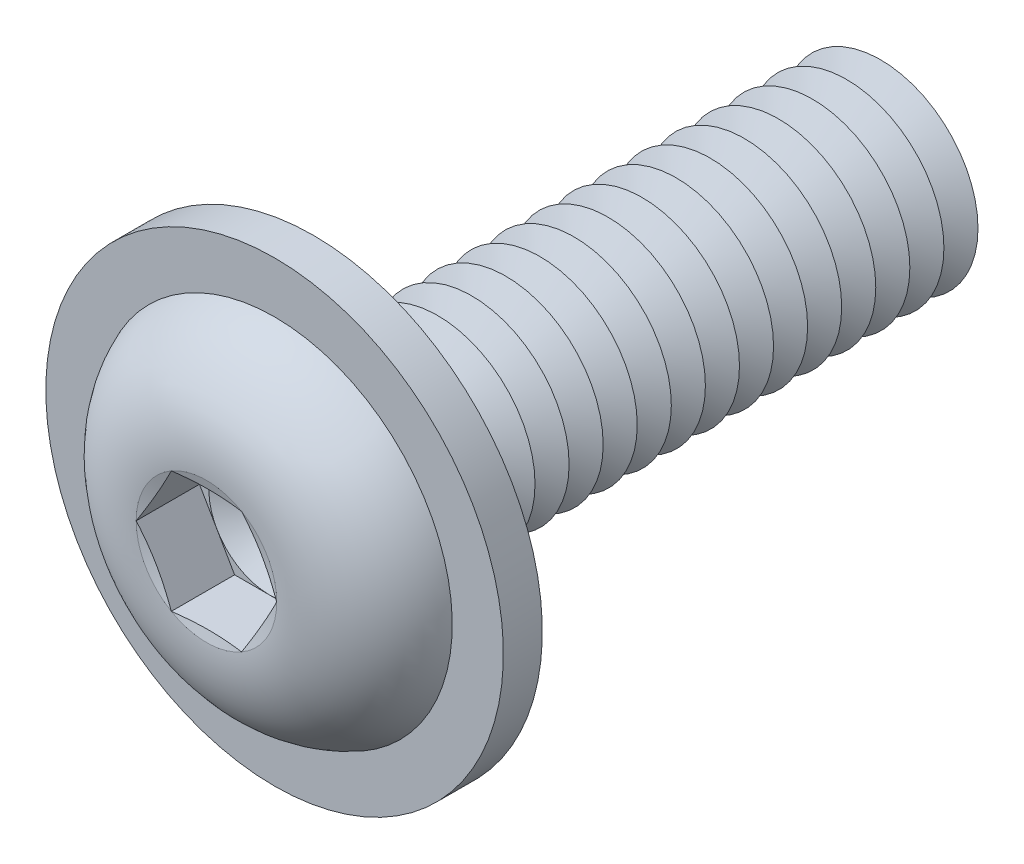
ISO-10303-21;
HEADER;
FILE_DESCRIPTION(('STEP AP214'),'2;1');
FILE_NAME('part.step','',(''),(''),'','','');
FILE_SCHEMA(('AUTOMOTIVE_DESIGN { 1 0 10303 214 1 1 1 1 }'));
ENDSEC;
DATA;
#1=APPLICATION_CONTEXT('core data for automotive mechanical design processes');
#2=APPLICATION_PROTOCOL_DEFINITION('international standard','automotive_design',2000,#1);
#3=PRODUCT_CONTEXT('',#1,'mechanical');
#4=PRODUCT('Part','Part','',(#3));
#5=PRODUCT_RELATED_PRODUCT_CATEGORY('part','',(#4));
#6=PRODUCT_DEFINITION_FORMATION('','',#4);
#7=PRODUCT_DEFINITION_CONTEXT('part definition',#1,'design');
#8=PRODUCT_DEFINITION('design','',#6,#7);
#9=PRODUCT_DEFINITION_SHAPE('','',#8);
#10=(LENGTH_UNIT() NAMED_UNIT(*) SI_UNIT(.MILLI.,.METRE.));
#11=(NAMED_UNIT(*) PLANE_ANGLE_UNIT() SI_UNIT($,.RADIAN.));
#12=(NAMED_UNIT(*) SI_UNIT($,.STERADIAN.) SOLID_ANGLE_UNIT());
#13=UNCERTAINTY_MEASURE_WITH_UNIT(LENGTH_MEASURE(1.E-05),#10,'distance_accuracy_value','');
#14=(GEOMETRIC_REPRESENTATION_CONTEXT(3) GLOBAL_UNCERTAINTY_ASSIGNED_CONTEXT((#13)) GLOBAL_UNIT_ASSIGNED_CONTEXT((#10,
#11,#12)) REPRESENTATION_CONTEXT('',''));
#15=CARTESIAN_POINT('',(0.,0.,0.));
#16=DIRECTION('',(0.,0.,1.));
#17=DIRECTION('',(1.,0.,0.));
#18=AXIS2_PLACEMENT_3D('',#15,#16,#17);
#19=CARTESIAN_POINT('',(0.,0.,-9.55));
#20=DIRECTION('',(0.,0.,1.));
#21=DIRECTION('',(1.,0.,0.));
#22=AXIS2_PLACEMENT_3D('',#19,#20,#21);
#23=CONICAL_SURFACE('',#22,2.,1.0471975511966);
#24=CARTESIAN_POINT('',(0.,0.,-9.9));
#25=DIRECTION('',(0.,0.,1.));
#26=DIRECTION('',(1.,0.,0.));
#27=AXIS2_PLACEMENT_3D('',#24,#25,#26);
#28=CIRCLE('',#27,1.3937822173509);
#29=CARTESIAN_POINT('',(1.3937822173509,0.,-9.9));
#30=VERTEX_POINT('',#29);
#31=EDGE_CURVE('E346',#30,#30,#28,.T.);
#32=ORIENTED_EDGE('',*,*,#31,.T.);
#33=EDGE_LOOP('',(#32));
#34=FACE_BOUND('',#33,.T.);
#35=CARTESIAN_POINT('',(0.,0.,-9.55));
#36=DIRECTION('',(0.,0.,1.));
#37=DIRECTION('',(1.,0.,0.));
#38=AXIS2_PLACEMENT_3D('',#35,#36,#37);
#39=CIRCLE('',#38,2.);
#40=CARTESIAN_POINT('',(2.,0.,-9.55));
#41=VERTEX_POINT('',#40);
#42=EDGE_CURVE('E342',#41,#41,#39,.T.);
#43=ORIENTED_EDGE('',*,*,#42,.F.);
#44=EDGE_LOOP('',(#43));
#45=FACE_BOUND('',#44,.T.);
#46=ADVANCED_FACE('F39',(#34,#45),#23,.T.);
#47=CARTESIAN_POINT('',(0.,0.,-9.9));
#48=DIRECTION('',(0.,0.,-1.));
#49=DIRECTION('',(-1.,0.,0.));
#50=AXIS2_PLACEMENT_3D('',#47,#48,#49);
#51=CONICAL_SURFACE('',#50,1.3937822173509,1.0471975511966);
#52=CARTESIAN_POINT('',(0.,0.,-10.25));
#53=DIRECTION('',(0.,0.,1.));
#54=DIRECTION('',(1.,0.,0.));
#55=AXIS2_PLACEMENT_3D('',#52,#53,#54);
#56=CIRCLE('',#55,2.);
#57=CARTESIAN_POINT('',(2.,0.,-10.25));
#58=VERTEX_POINT('',#57);
#59=EDGE_CURVE('E350',#58,#58,#56,.T.);
#60=ORIENTED_EDGE('',*,*,#59,.T.);
#61=EDGE_LOOP('',(#60));
#62=FACE_BOUND('',#61,.T.);
#63=ORIENTED_EDGE('',*,*,#31,.F.);
#64=EDGE_LOOP('',(#63));
#65=FACE_BOUND('',#64,.T.);
#66=ADVANCED_FACE('F474',(#62,#65),#51,.T.);
#67=CARTESIAN_POINT('',(0.,2.00000000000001,-12.));
#68=DIRECTION('',(0.,0.,-1.));
#69=DIRECTION('',(-1.,0.,0.));
#70=AXIS2_PLACEMENT_3D('',#67,#68,#69);
#71=PLANE('',#70);
#72=CARTESIAN_POINT('',(0.,0.,-12.));
#73=DIRECTION('',(0.,0.,1.));
#74=DIRECTION('',(1.,0.,0.));
#75=AXIS2_PLACEMENT_3D('',#72,#73,#74);
#76=CIRCLE('',#75,1.3937822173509);
#77=CARTESIAN_POINT('',(1.3937822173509,0.,-12.));
#78=VERTEX_POINT('',#77);
#79=EDGE_CURVE('E370',#78,#78,#76,.T.);
#80=ORIENTED_EDGE('',*,*,#79,.F.);
#81=EDGE_LOOP('',(#80));
#82=FACE_BOUND('',#81,.T.);
#83=ADVANCED_FACE('F480',(#82),#71,.T.);
#84=CARTESIAN_POINT('',(0.,0.,-11.65));
#85=DIRECTION('',(0.,0.,1.));
#86=DIRECTION('',(1.,0.,0.));
#87=AXIS2_PLACEMENT_3D('',#84,#85,#86);
#88=CONICAL_SURFACE('',#87,2.,1.0471975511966);
#89=ORIENTED_EDGE('',*,*,#79,.T.);
#90=EDGE_LOOP('',(#89));
#91=FACE_BOUND('',#90,.T.);
#92=CARTESIAN_POINT('',(0.,0.,-11.65));
#93=DIRECTION('',(0.,0.,1.));
#94=DIRECTION('',(1.,0.,0.));
#95=AXIS2_PLACEMENT_3D('',#92,#93,#94);
#96=CIRCLE('',#95,2.);
#97=CARTESIAN_POINT('',(2.,0.,-11.65));
#98=VERTEX_POINT('',#97);
#99=EDGE_CURVE('E366',#98,#98,#96,.T.);
#100=ORIENTED_EDGE('',*,*,#99,.F.);
#101=EDGE_LOOP('',(#100));
#102=FACE_BOUND('',#101,.T.);
#103=ADVANCED_FACE('F499',(#91,#102),#88,.T.);
#104=CARTESIAN_POINT('',(0.,0.,-11.3));
#105=DIRECTION('',(0.,0.,-1.));
#106=DIRECTION('',(-1.,0.,0.));
#107=AXIS2_PLACEMENT_3D('',#104,#105,#106);
#108=CONICAL_SURFACE('',#107,1.3937822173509,1.0471975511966);
#109=ORIENTED_EDGE('',*,*,#99,.T.);
#110=EDGE_LOOP('',(#109));
#111=FACE_BOUND('',#110,.T.);
#112=CARTESIAN_POINT('',(0.,0.,-11.3));
#113=DIRECTION('',(0.,0.,1.));
#114=DIRECTION('',(1.,0.,0.));
#115=AXIS2_PLACEMENT_3D('',#112,#113,#114);
#116=CIRCLE('',#115,1.3937822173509);
#117=CARTESIAN_POINT('',(1.3937822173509,0.,-11.3));
#118=VERTEX_POINT('',#117);
#119=EDGE_CURVE('E362',#118,#118,#116,.T.);
#120=ORIENTED_EDGE('',*,*,#119,.F.);
#121=EDGE_LOOP('',(#120));
#122=FACE_BOUND('',#121,.T.);
#123=ADVANCED_FACE('F496',(#111,#122),#108,.T.);
#124=CARTESIAN_POINT('',(0.,0.,-10.95));
#125=DIRECTION('',(0.,0.,1.));
#126=DIRECTION('',(1.,0.,0.));
#127=AXIS2_PLACEMENT_3D('',#124,#125,#126);
#128=CONICAL_SURFACE('',#127,2.,1.0471975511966);
#129=ORIENTED_EDGE('',*,*,#119,.T.);
#130=EDGE_LOOP('',(#129));
#131=FACE_BOUND('',#130,.T.);
#132=CARTESIAN_POINT('',(0.,0.,-10.95));
#133=DIRECTION('',(0.,0.,1.));
#134=DIRECTION('',(1.,0.,0.));
#135=AXIS2_PLACEMENT_3D('',#132,#133,#134);
#136=CIRCLE('',#135,2.);
#137=CARTESIAN_POINT('',(2.,0.,-10.95));
#138=VERTEX_POINT('',#137);
#139=EDGE_CURVE('E358',#138,#138,#136,.T.);
#140=ORIENTED_EDGE('',*,*,#139,.F.);
#141=EDGE_LOOP('',(#140));
#142=FACE_BOUND('',#141,.T.);
#143=ADVANCED_FACE('F490',(#131,#142),#128,.T.);
#144=CARTESIAN_POINT('',(0.,0.,-10.6));
#145=DIRECTION('',(0.,0.,-1.));
#146=DIRECTION('',(-1.,0.,0.));
#147=AXIS2_PLACEMENT_3D('',#144,#145,#146);
#148=CONICAL_SURFACE('',#147,1.3937822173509,1.0471975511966);
#149=ORIENTED_EDGE('',*,*,#139,.T.);
#150=EDGE_LOOP('',(#149));
#151=FACE_BOUND('',#150,.T.);
#152=CARTESIAN_POINT('',(0.,0.,-10.6));
#153=DIRECTION('',(0.,0.,1.));
#154=DIRECTION('',(1.,0.,0.));
#155=AXIS2_PLACEMENT_3D('',#152,#153,#154);
#156=CIRCLE('',#155,1.3937822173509);
#157=CARTESIAN_POINT('',(1.3937822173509,0.,-10.6));
#158=VERTEX_POINT('',#157);
#159=EDGE_CURVE('E354',#158,#158,#156,.T.);
#160=ORIENTED_EDGE('',*,*,#159,.F.);
#161=EDGE_LOOP('',(#160));
#162=FACE_BOUND('',#161,.T.);
#163=ADVANCED_FACE('F486',(#151,#162),#148,.T.);
#164=CARTESIAN_POINT('',(0.,0.,-10.25));
#165=DIRECTION('',(0.,0.,1.));
#166=DIRECTION('',(1.,0.,0.));
#167=AXIS2_PLACEMENT_3D('',#164,#165,#166);
#168=CONICAL_SURFACE('',#167,2.,1.0471975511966);
#169=ORIENTED_EDGE('',*,*,#159,.T.);
#170=EDGE_LOOP('',(#169));
#171=FACE_BOUND('',#170,.T.);
#172=ORIENTED_EDGE('',*,*,#59,.F.);
#173=EDGE_LOOP('',(#172));
#174=FACE_BOUND('',#173,.T.);
#175=ADVANCED_FACE('F489',(#171,#174),#168,.T.);
#176=CARTESIAN_POINT('',(0.,0.,-8.85));
#177=DIRECTION('',(0.,0.,1.));
#178=DIRECTION('',(1.,0.,0.));
#179=AXIS2_PLACEMENT_3D('',#176,#177,#178);
#180=CONICAL_SURFACE('',#179,2.,1.0471975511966);
#181=CARTESIAN_POINT('',(0.,0.,-9.2));
#182=DIRECTION('',(0.,0.,1.));
#183=DIRECTION('',(1.,0.,0.));
#184=AXIS2_PLACEMENT_3D('',#181,#182,#183);
#185=CIRCLE('',#184,1.3937822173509);
#186=CARTESIAN_POINT('',(1.3937822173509,0.,-9.2));
#187=VERTEX_POINT('',#186);
#188=EDGE_CURVE('E338',#187,#187,#185,.T.);
#189=ORIENTED_EDGE('',*,*,#188,.T.);
#190=EDGE_LOOP('',(#189));
#191=FACE_BOUND('',#190,.T.);
#192=CARTESIAN_POINT('',(0.,0.,-8.85));
#193=DIRECTION('',(0.,0.,1.));
#194=DIRECTION('',(1.,0.,0.));
#195=AXIS2_PLACEMENT_3D('',#192,#193,#194);
#196=CIRCLE('',#195,2.);
#197=CARTESIAN_POINT('',(2.,0.,-8.85));
#198=VERTEX_POINT('',#197);
#199=EDGE_CURVE('E334',#198,#198,#196,.T.);
#200=ORIENTED_EDGE('',*,*,#199,.F.);
#201=EDGE_LOOP('',(#200));
#202=FACE_BOUND('',#201,.T.);
#203=ADVANCED_FACE('F494',(#191,#202),#180,.T.);
#204=CARTESIAN_POINT('',(0.,0.,-9.2));
#205=DIRECTION('',(0.,0.,-1.));
#206=DIRECTION('',(-1.,0.,0.));
#207=AXIS2_PLACEMENT_3D('',#204,#205,#206);
#208=CONICAL_SURFACE('',#207,1.3937822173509,1.0471975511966);
#209=ORIENTED_EDGE('',*,*,#42,.T.);
#210=EDGE_LOOP('',(#209));
#211=FACE_BOUND('',#210,.T.);
#212=ORIENTED_EDGE('',*,*,#188,.F.);
#213=EDGE_LOOP('',(#212));
#214=FACE_BOUND('',#213,.T.);
#215=ADVANCED_FACE('F545',(#211,#214),#208,.T.);
#216=CARTESIAN_POINT('',(0.,0.,-8.15));
#217=DIRECTION('',(0.,0.,1.));
#218=DIRECTION('',(1.,0.,0.));
#219=AXIS2_PLACEMENT_3D('',#216,#217,#218);
#220=CONICAL_SURFACE('',#219,2.,1.0471975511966);
#221=CARTESIAN_POINT('',(0.,0.,-8.5));
#222=DIRECTION('',(0.,0.,1.));
#223=DIRECTION('',(1.,0.,0.));
#224=AXIS2_PLACEMENT_3D('',#221,#222,#223);
#225=CIRCLE('',#224,1.3937822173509);
#226=CARTESIAN_POINT('',(1.3937822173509,0.,-8.5));
#227=VERTEX_POINT('',#226);
#228=EDGE_CURVE('E330',#227,#227,#225,.T.);
#229=ORIENTED_EDGE('',*,*,#228,.T.);
#230=EDGE_LOOP('',(#229));
#231=FACE_BOUND('',#230,.T.);
#232=CARTESIAN_POINT('',(0.,0.,-8.15));
#233=DIRECTION('',(0.,0.,1.));
#234=DIRECTION('',(1.,0.,0.));
#235=AXIS2_PLACEMENT_3D('',#232,#233,#234);
#236=CIRCLE('',#235,2.);
#237=CARTESIAN_POINT('',(2.,0.,-8.15));
#238=VERTEX_POINT('',#237);
#239=EDGE_CURVE('E326',#238,#238,#236,.T.);
#240=ORIENTED_EDGE('',*,*,#239,.F.);
#241=EDGE_LOOP('',(#240));
#242=FACE_BOUND('',#241,.T.);
#243=ADVANCED_FACE('F551',(#231,#242),#220,.T.);
#244=CARTESIAN_POINT('',(0.,0.,-8.5));
#245=DIRECTION('',(0.,0.,-1.));
#246=DIRECTION('',(-1.,0.,0.));
#247=AXIS2_PLACEMENT_3D('',#244,#245,#246);
#248=CONICAL_SURFACE('',#247,1.3937822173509,1.0471975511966);
#249=ORIENTED_EDGE('',*,*,#199,.T.);
#250=EDGE_LOOP('',(#249));
#251=FACE_BOUND('',#250,.T.);
#252=ORIENTED_EDGE('',*,*,#228,.F.);
#253=EDGE_LOOP('',(#252));
#254=FACE_BOUND('',#253,.T.);
#255=ADVANCED_FACE('F558',(#251,#254),#248,.T.);
#256=CARTESIAN_POINT('',(0.,0.,-7.45));
#257=DIRECTION('',(0.,0.,1.));
#258=DIRECTION('',(1.,0.,0.));
#259=AXIS2_PLACEMENT_3D('',#256,#257,#258);
#260=CONICAL_SURFACE('',#259,2.,1.0471975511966);
#261=CARTESIAN_POINT('',(0.,0.,-7.8));
#262=DIRECTION('',(0.,0.,1.));
#263=DIRECTION('',(1.,0.,0.));
#264=AXIS2_PLACEMENT_3D('',#261,#262,#263);
#265=CIRCLE('',#264,1.3937822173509);
#266=CARTESIAN_POINT('',(1.3937822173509,0.,-7.8));
#267=VERTEX_POINT('',#266);
#268=EDGE_CURVE('E322',#267,#267,#265,.T.);
#269=ORIENTED_EDGE('',*,*,#268,.T.);
#270=EDGE_LOOP('',(#269));
#271=FACE_BOUND('',#270,.T.);
#272=CARTESIAN_POINT('',(0.,0.,-7.45));
#273=DIRECTION('',(0.,0.,1.));
#274=DIRECTION('',(1.,0.,0.));
#275=AXIS2_PLACEMENT_3D('',#272,#273,#274);
#276=CIRCLE('',#275,2.);
#277=CARTESIAN_POINT('',(2.,0.,-7.45));
#278=VERTEX_POINT('',#277);
#279=EDGE_CURVE('E318',#278,#278,#276,.T.);
#280=ORIENTED_EDGE('',*,*,#279,.F.);
#281=EDGE_LOOP('',(#280));
#282=FACE_BOUND('',#281,.T.);
#283=ADVANCED_FACE('F565',(#271,#282),#260,.T.);
#284=CARTESIAN_POINT('',(0.,0.,-7.8));
#285=DIRECTION('',(0.,0.,-1.));
#286=DIRECTION('',(-1.,0.,0.));
#287=AXIS2_PLACEMENT_3D('',#284,#285,#286);
#288=CONICAL_SURFACE('',#287,1.3937822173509,1.0471975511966);
#289=ORIENTED_EDGE('',*,*,#239,.T.);
#290=EDGE_LOOP('',(#289));
#291=FACE_BOUND('',#290,.T.);
#292=ORIENTED_EDGE('',*,*,#268,.F.);
#293=EDGE_LOOP('',(#292));
#294=FACE_BOUND('',#293,.T.);
#295=ADVANCED_FACE('F572',(#291,#294),#288,.T.);
#296=CARTESIAN_POINT('',(0.,0.,-6.75));
#297=DIRECTION('',(0.,0.,1.));
#298=DIRECTION('',(1.,0.,0.));
#299=AXIS2_PLACEMENT_3D('',#296,#297,#298);
#300=CONICAL_SURFACE('',#299,2.,1.0471975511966);
#301=CARTESIAN_POINT('',(0.,0.,-7.1));
#302=DIRECTION('',(0.,0.,1.));
#303=DIRECTION('',(1.,0.,0.));
#304=AXIS2_PLACEMENT_3D('',#301,#302,#303);
#305=CIRCLE('',#304,1.3937822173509);
#306=CARTESIAN_POINT('',(1.3937822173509,0.,-7.1));
#307=VERTEX_POINT('',#306);
#308=EDGE_CURVE('E314',#307,#307,#305,.T.);
#309=ORIENTED_EDGE('',*,*,#308,.T.);
#310=EDGE_LOOP('',(#309));
#311=FACE_BOUND('',#310,.T.);
#312=CARTESIAN_POINT('',(0.,0.,-6.75));
#313=DIRECTION('',(0.,0.,1.));
#314=DIRECTION('',(1.,0.,0.));
#315=AXIS2_PLACEMENT_3D('',#312,#313,#314);
#316=CIRCLE('',#315,2.);
#317=CARTESIAN_POINT('',(2.,0.,-6.75));
#318=VERTEX_POINT('',#317);
#319=EDGE_CURVE('E310',#318,#318,#316,.T.);
#320=ORIENTED_EDGE('',*,*,#319,.F.);
#321=EDGE_LOOP('',(#320));
#322=FACE_BOUND('',#321,.T.);
#323=ADVANCED_FACE('F579',(#311,#322),#300,.T.);
#324=CARTESIAN_POINT('',(0.,0.,-7.1));
#325=DIRECTION('',(0.,0.,-1.));
#326=DIRECTION('',(-1.,0.,0.));
#327=AXIS2_PLACEMENT_3D('',#324,#325,#326);
#328=CONICAL_SURFACE('',#327,1.3937822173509,1.0471975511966);
#329=ORIENTED_EDGE('',*,*,#279,.T.);
#330=EDGE_LOOP('',(#329));
#331=FACE_BOUND('',#330,.T.);
#332=ORIENTED_EDGE('',*,*,#308,.F.);
#333=EDGE_LOOP('',(#332));
#334=FACE_BOUND('',#333,.T.);
#335=ADVANCED_FACE('F586',(#331,#334),#328,.T.);
#336=CARTESIAN_POINT('',(0.,0.,-6.05));
#337=DIRECTION('',(0.,0.,1.));
#338=DIRECTION('',(1.,0.,0.));
#339=AXIS2_PLACEMENT_3D('',#336,#337,#338);
#340=CONICAL_SURFACE('',#339,2.,1.0471975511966);
#341=CARTESIAN_POINT('',(0.,0.,-6.4));
#342=DIRECTION('',(0.,0.,1.));
#343=DIRECTION('',(1.,0.,0.));
#344=AXIS2_PLACEMENT_3D('',#341,#342,#343);
#345=CIRCLE('',#344,1.3937822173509);
#346=CARTESIAN_POINT('',(1.3937822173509,0.,-6.4));
#347=VERTEX_POINT('',#346);
#348=EDGE_CURVE('E306',#347,#347,#345,.T.);
#349=ORIENTED_EDGE('',*,*,#348,.T.);
#350=EDGE_LOOP('',(#349));
#351=FACE_BOUND('',#350,.T.);
#352=CARTESIAN_POINT('',(0.,0.,-6.05));
#353=DIRECTION('',(0.,0.,1.));
#354=DIRECTION('',(1.,0.,0.));
#355=AXIS2_PLACEMENT_3D('',#352,#353,#354);
#356=CIRCLE('',#355,2.);
#357=CARTESIAN_POINT('',(2.,0.,-6.05));
#358=VERTEX_POINT('',#357);
#359=EDGE_CURVE('E302',#358,#358,#356,.T.);
#360=ORIENTED_EDGE('',*,*,#359,.F.);
#361=EDGE_LOOP('',(#360));
#362=FACE_BOUND('',#361,.T.);
#363=ADVANCED_FACE('F593',(#351,#362),#340,.T.);
#364=CARTESIAN_POINT('',(0.,0.,-6.4));
#365=DIRECTION('',(0.,0.,-1.));
#366=DIRECTION('',(-1.,0.,0.));
#367=AXIS2_PLACEMENT_3D('',#364,#365,#366);
#368=CONICAL_SURFACE('',#367,1.3937822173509,1.0471975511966);
#369=ORIENTED_EDGE('',*,*,#319,.T.);
#370=EDGE_LOOP('',(#369));
#371=FACE_BOUND('',#370,.T.);
#372=ORIENTED_EDGE('',*,*,#348,.F.);
#373=EDGE_LOOP('',(#372));
#374=FACE_BOUND('',#373,.T.);
#375=ADVANCED_FACE('F600',(#371,#374),#368,.T.);
#376=CARTESIAN_POINT('',(0.,0.,-5.35));
#377=DIRECTION('',(0.,0.,1.));
#378=DIRECTION('',(1.,0.,0.));
#379=AXIS2_PLACEMENT_3D('',#376,#377,#378);
#380=CONICAL_SURFACE('',#379,2.,1.0471975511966);
#381=CARTESIAN_POINT('',(0.,0.,-5.7));
#382=DIRECTION('',(0.,0.,1.));
#383=DIRECTION('',(1.,0.,0.));
#384=AXIS2_PLACEMENT_3D('',#381,#382,#383);
#385=CIRCLE('',#384,1.3937822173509);
#386=CARTESIAN_POINT('',(1.3937822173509,0.,-5.7));
#387=VERTEX_POINT('',#386);
#388=EDGE_CURVE('E298',#387,#387,#385,.T.);
#389=ORIENTED_EDGE('',*,*,#388,.T.);
#390=EDGE_LOOP('',(#389));
#391=FACE_BOUND('',#390,.T.);
#392=CARTESIAN_POINT('',(0.,0.,-5.35));
#393=DIRECTION('',(0.,0.,1.));
#394=DIRECTION('',(1.,0.,0.));
#395=AXIS2_PLACEMENT_3D('',#392,#393,#394);
#396=CIRCLE('',#395,2.);
#397=CARTESIAN_POINT('',(2.,0.,-5.35));
#398=VERTEX_POINT('',#397);
#399=EDGE_CURVE('E294',#398,#398,#396,.T.);
#400=ORIENTED_EDGE('',*,*,#399,.F.);
#401=EDGE_LOOP('',(#400));
#402=FACE_BOUND('',#401,.T.);
#403=ADVANCED_FACE('F607',(#391,#402),#380,.T.);
#404=CARTESIAN_POINT('',(0.,0.,-5.7));
#405=DIRECTION('',(0.,0.,-1.));
#406=DIRECTION('',(-1.,0.,0.));
#407=AXIS2_PLACEMENT_3D('',#404,#405,#406);
#408=CONICAL_SURFACE('',#407,1.3937822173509,1.0471975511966);
#409=ORIENTED_EDGE('',*,*,#359,.T.);
#410=EDGE_LOOP('',(#409));
#411=FACE_BOUND('',#410,.T.);
#412=ORIENTED_EDGE('',*,*,#388,.F.);
#413=EDGE_LOOP('',(#412));
#414=FACE_BOUND('',#413,.T.);
#415=ADVANCED_FACE('F614',(#411,#414),#408,.T.);
#416=CARTESIAN_POINT('',(0.,0.,-4.65));
#417=DIRECTION('',(0.,0.,1.));
#418=DIRECTION('',(1.,0.,0.));
#419=AXIS2_PLACEMENT_3D('',#416,#417,#418);
#420=CONICAL_SURFACE('',#419,2.,1.0471975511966);
#421=CARTESIAN_POINT('',(0.,0.,-5.));
#422=DIRECTION('',(0.,0.,1.));
#423=DIRECTION('',(1.,0.,0.));
#424=AXIS2_PLACEMENT_3D('',#421,#422,#423);
#425=CIRCLE('',#424,1.3937822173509);
#426=CARTESIAN_POINT('',(1.3937822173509,0.,-5.));
#427=VERTEX_POINT('',#426);
#428=EDGE_CURVE('E290',#427,#427,#425,.T.);
#429=ORIENTED_EDGE('',*,*,#428,.T.);
#430=EDGE_LOOP('',(#429));
#431=FACE_BOUND('',#430,.T.);
#432=CARTESIAN_POINT('',(0.,0.,-4.65));
#433=DIRECTION('',(0.,0.,1.));
#434=DIRECTION('',(1.,0.,0.));
#435=AXIS2_PLACEMENT_3D('',#432,#433,#434);
#436=CIRCLE('',#435,2.);
#437=CARTESIAN_POINT('',(2.,0.,-4.65));
#438=VERTEX_POINT('',#437);
#439=EDGE_CURVE('E286',#438,#438,#436,.T.);
#440=ORIENTED_EDGE('',*,*,#439,.F.);
#441=EDGE_LOOP('',(#440));
#442=FACE_BOUND('',#441,.T.);
#443=ADVANCED_FACE('F621',(#431,#442),#420,.T.);
#444=CARTESIAN_POINT('',(0.,0.,-5.));
#445=DIRECTION('',(0.,0.,-1.));
#446=DIRECTION('',(-1.,0.,0.));
#447=AXIS2_PLACEMENT_3D('',#444,#445,#446);
#448=CONICAL_SURFACE('',#447,1.3937822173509,1.0471975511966);
#449=ORIENTED_EDGE('',*,*,#399,.T.);
#450=EDGE_LOOP('',(#449));
#451=FACE_BOUND('',#450,.T.);
#452=ORIENTED_EDGE('',*,*,#428,.F.);
#453=EDGE_LOOP('',(#452));
#454=FACE_BOUND('',#453,.T.);
#455=ADVANCED_FACE('F628',(#451,#454),#448,.T.);
#456=CARTESIAN_POINT('',(0.,0.,-3.95));
#457=DIRECTION('',(0.,0.,1.));
#458=DIRECTION('',(1.,0.,0.));
#459=AXIS2_PLACEMENT_3D('',#456,#457,#458);
#460=CONICAL_SURFACE('',#459,2.,1.0471975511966);
#461=CARTESIAN_POINT('',(0.,0.,-4.3));
#462=DIRECTION('',(0.,0.,1.));
#463=DIRECTION('',(1.,0.,0.));
#464=AXIS2_PLACEMENT_3D('',#461,#462,#463);
#465=CIRCLE('',#464,1.3937822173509);
#466=CARTESIAN_POINT('',(1.3937822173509,0.,-4.3));
#467=VERTEX_POINT('',#466);
#468=EDGE_CURVE('E282',#467,#467,#465,.T.);
#469=ORIENTED_EDGE('',*,*,#468,.T.);
#470=EDGE_LOOP('',(#469));
#471=FACE_BOUND('',#470,.T.);
#472=CARTESIAN_POINT('',(0.,0.,-3.95));
#473=DIRECTION('',(0.,0.,1.));
#474=DIRECTION('',(1.,0.,0.));
#475=AXIS2_PLACEMENT_3D('',#472,#473,#474);
#476=CIRCLE('',#475,2.);
#477=CARTESIAN_POINT('',(2.,0.,-3.95));
#478=VERTEX_POINT('',#477);
#479=EDGE_CURVE('E278',#478,#478,#476,.T.);
#480=ORIENTED_EDGE('',*,*,#479,.F.);
#481=EDGE_LOOP('',(#480));
#482=FACE_BOUND('',#481,.T.);
#483=ADVANCED_FACE('F635',(#471,#482),#460,.T.);
#484=CARTESIAN_POINT('',(0.,0.,-4.3));
#485=DIRECTION('',(0.,0.,-1.));
#486=DIRECTION('',(-1.,0.,0.));
#487=AXIS2_PLACEMENT_3D('',#484,#485,#486);
#488=CONICAL_SURFACE('',#487,1.3937822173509,1.0471975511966);
#489=ORIENTED_EDGE('',*,*,#439,.T.);
#490=EDGE_LOOP('',(#489));
#491=FACE_BOUND('',#490,.T.);
#492=ORIENTED_EDGE('',*,*,#468,.F.);
#493=EDGE_LOOP('',(#492));
#494=FACE_BOUND('',#493,.T.);
#495=ADVANCED_FACE('F642',(#491,#494),#488,.T.);
#496=CARTESIAN_POINT('',(0.,0.,-3.25));
#497=DIRECTION('',(0.,0.,1.));
#498=DIRECTION('',(1.,0.,0.));
#499=AXIS2_PLACEMENT_3D('',#496,#497,#498);
#500=CONICAL_SURFACE('',#499,2.,1.0471975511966);
#501=CARTESIAN_POINT('',(0.,0.,-3.6));
#502=DIRECTION('',(0.,0.,1.));
#503=DIRECTION('',(1.,0.,0.));
#504=AXIS2_PLACEMENT_3D('',#501,#502,#503);
#505=CIRCLE('',#504,1.3937822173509);
#506=CARTESIAN_POINT('',(1.3937822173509,0.,-3.6));
#507=VERTEX_POINT('',#506);
#508=EDGE_CURVE('E274',#507,#507,#505,.T.);
#509=ORIENTED_EDGE('',*,*,#508,.T.);
#510=EDGE_LOOP('',(#509));
#511=FACE_BOUND('',#510,.T.);
#512=CARTESIAN_POINT('',(0.,0.,-3.25));
#513=DIRECTION('',(0.,0.,1.));
#514=DIRECTION('',(1.,0.,0.));
#515=AXIS2_PLACEMENT_3D('',#512,#513,#514);
#516=CIRCLE('',#515,2.);
#517=CARTESIAN_POINT('',(2.,0.,-3.25));
#518=VERTEX_POINT('',#517);
#519=EDGE_CURVE('E270',#518,#518,#516,.T.);
#520=ORIENTED_EDGE('',*,*,#519,.F.);
#521=EDGE_LOOP('',(#520));
#522=FACE_BOUND('',#521,.T.);
#523=ADVANCED_FACE('F649',(#511,#522),#500,.T.);
#524=CARTESIAN_POINT('',(0.,0.,-3.6));
#525=DIRECTION('',(0.,0.,-1.));
#526=DIRECTION('',(-1.,0.,0.));
#527=AXIS2_PLACEMENT_3D('',#524,#525,#526);
#528=CONICAL_SURFACE('',#527,1.3937822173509,1.0471975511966);
#529=ORIENTED_EDGE('',*,*,#479,.T.);
#530=EDGE_LOOP('',(#529));
#531=FACE_BOUND('',#530,.T.);
#532=ORIENTED_EDGE('',*,*,#508,.F.);
#533=EDGE_LOOP('',(#532));
#534=FACE_BOUND('',#533,.T.);
#535=ADVANCED_FACE('F656',(#531,#534),#528,.T.);
#536=CARTESIAN_POINT('',(0.,0.,-2.55));
#537=DIRECTION('',(0.,0.,1.));
#538=DIRECTION('',(1.,0.,0.));
#539=AXIS2_PLACEMENT_3D('',#536,#537,#538);
#540=CONICAL_SURFACE('',#539,2.,1.0471975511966);
#541=CARTESIAN_POINT('',(0.,0.,-2.9));
#542=DIRECTION('',(0.,0.,1.));
#543=DIRECTION('',(1.,0.,0.));
#544=AXIS2_PLACEMENT_3D('',#541,#542,#543);
#545=CIRCLE('',#544,1.3937822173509);
#546=CARTESIAN_POINT('',(1.3937822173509,0.,-2.9));
#547=VERTEX_POINT('',#546);
#548=EDGE_CURVE('E266',#547,#547,#545,.T.);
#549=ORIENTED_EDGE('',*,*,#548,.T.);
#550=EDGE_LOOP('',(#549));
#551=FACE_BOUND('',#550,.T.);
#552=CARTESIAN_POINT('',(0.,0.,-2.55));
#553=DIRECTION('',(0.,0.,1.));
#554=DIRECTION('',(1.,0.,0.));
#555=AXIS2_PLACEMENT_3D('',#552,#553,#554);
#556=CIRCLE('',#555,2.);
#557=CARTESIAN_POINT('',(2.,0.,-2.55));
#558=VERTEX_POINT('',#557);
#559=EDGE_CURVE('E262',#558,#558,#556,.T.);
#560=ORIENTED_EDGE('',*,*,#559,.F.);
#561=EDGE_LOOP('',(#560));
#562=FACE_BOUND('',#561,.T.);
#563=ADVANCED_FACE('F663',(#551,#562),#540,.T.);
#564=CARTESIAN_POINT('',(0.,0.,-2.9));
#565=DIRECTION('',(0.,0.,-1.));
#566=DIRECTION('',(-1.,0.,0.));
#567=AXIS2_PLACEMENT_3D('',#564,#565,#566);
#568=CONICAL_SURFACE('',#567,1.3937822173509,1.0471975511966);
#569=ORIENTED_EDGE('',*,*,#519,.T.);
#570=EDGE_LOOP('',(#569));
#571=FACE_BOUND('',#570,.T.);
#572=ORIENTED_EDGE('',*,*,#548,.F.);
#573=EDGE_LOOP('',(#572));
#574=FACE_BOUND('',#573,.T.);
#575=ADVANCED_FACE('F670',(#571,#574),#568,.T.);
#576=CARTESIAN_POINT('',(0.,0.,-1.85));
#577=DIRECTION('',(0.,0.,1.));
#578=DIRECTION('',(1.,0.,0.));
#579=AXIS2_PLACEMENT_3D('',#576,#577,#578);
#580=CONICAL_SURFACE('',#579,2.,1.0471975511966);
#581=CARTESIAN_POINT('',(0.,0.,-2.2));
#582=DIRECTION('',(0.,0.,1.));
#583=DIRECTION('',(1.,0.,0.));
#584=AXIS2_PLACEMENT_3D('',#581,#582,#583);
#585=CIRCLE('',#584,1.3937822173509);
#586=CARTESIAN_POINT('',(1.3937822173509,0.,-2.2));
#587=VERTEX_POINT('',#586);
#588=EDGE_CURVE('E258',#587,#587,#585,.T.);
#589=ORIENTED_EDGE('',*,*,#588,.T.);
#590=EDGE_LOOP('',(#589));
#591=FACE_BOUND('',#590,.T.);
#592=CARTESIAN_POINT('',(0.,0.,-1.85));
#593=DIRECTION('',(0.,0.,1.));
#594=DIRECTION('',(1.,0.,0.));
#595=AXIS2_PLACEMENT_3D('',#592,#593,#594);
#596=CIRCLE('',#595,2.);
#597=CARTESIAN_POINT('',(2.,0.,-1.85));
#598=VERTEX_POINT('',#597);
#599=EDGE_CURVE('E254',#598,#598,#596,.T.);
#600=ORIENTED_EDGE('',*,*,#599,.F.);
#601=EDGE_LOOP('',(#600));
#602=FACE_BOUND('',#601,.T.);
#603=ADVANCED_FACE('F677',(#591,#602),#580,.T.);
#604=CARTESIAN_POINT('',(0.,0.,-2.2));
#605=DIRECTION('',(0.,0.,-1.));
#606=DIRECTION('',(-1.,0.,0.));
#607=AXIS2_PLACEMENT_3D('',#604,#605,#606);
#608=CONICAL_SURFACE('',#607,1.3937822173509,1.0471975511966);
#609=ORIENTED_EDGE('',*,*,#559,.T.);
#610=EDGE_LOOP('',(#609));
#611=FACE_BOUND('',#610,.T.);
#612=ORIENTED_EDGE('',*,*,#588,.F.);
#613=EDGE_LOOP('',(#612));
#614=FACE_BOUND('',#613,.T.);
#615=ADVANCED_FACE('F684',(#611,#614),#608,.T.);
#616=CARTESIAN_POINT('',(0.,0.,-1.15));
#617=DIRECTION('',(0.,0.,1.));
#618=DIRECTION('',(1.,0.,0.));
#619=AXIS2_PLACEMENT_3D('',#616,#617,#618);
#620=CONICAL_SURFACE('',#619,2.,1.0471975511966);
#621=CARTESIAN_POINT('',(0.,0.,-1.5));
#622=DIRECTION('',(0.,0.,1.));
#623=DIRECTION('',(1.,0.,0.));
#624=AXIS2_PLACEMENT_3D('',#621,#622,#623);
#625=CIRCLE('',#624,1.3937822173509);
#626=CARTESIAN_POINT('',(1.3937822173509,0.,-1.5));
#627=VERTEX_POINT('',#626);
#628=EDGE_CURVE('E250',#627,#627,#625,.T.);
#629=ORIENTED_EDGE('',*,*,#628,.T.);
#630=EDGE_LOOP('',(#629));
#631=FACE_BOUND('',#630,.T.);
#632=CARTESIAN_POINT('',(0.,0.,-1.15));
#633=DIRECTION('',(0.,0.,1.));
#634=DIRECTION('',(1.,0.,0.));
#635=AXIS2_PLACEMENT_3D('',#632,#633,#634);
#636=CIRCLE('',#635,2.);
#637=CARTESIAN_POINT('',(2.,0.,-1.15));
#638=VERTEX_POINT('',#637);
#639=EDGE_CURVE('E242',#638,#638,#636,.T.);
#640=ORIENTED_EDGE('',*,*,#639,.F.);
#641=EDGE_LOOP('',(#640));
#642=FACE_BOUND('',#641,.T.);
#643=ADVANCED_FACE('F691',(#631,#642),#620,.T.);
#644=CARTESIAN_POINT('',(0.,0.,-1.5));
#645=DIRECTION('',(0.,0.,-1.));
#646=DIRECTION('',(-1.,0.,0.));
#647=AXIS2_PLACEMENT_3D('',#644,#645,#646);
#648=CONICAL_SURFACE('',#647,1.3937822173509,1.0471975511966);
#649=ORIENTED_EDGE('',*,*,#599,.T.);
#650=EDGE_LOOP('',(#649));
#651=FACE_BOUND('',#650,.T.);
#652=ORIENTED_EDGE('',*,*,#628,.F.);
#653=EDGE_LOOP('',(#652));
#654=FACE_BOUND('',#653,.T.);
#655=ADVANCED_FACE('F698',(#651,#654),#648,.T.);
#656=CARTESIAN_POINT('',(0.,0.,-0.450000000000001));
#657=DIRECTION('',(0.,0.,1.));
#658=DIRECTION('',(1.,0.,0.));
#659=AXIS2_PLACEMENT_3D('',#656,#657,#658);
#660=CONICAL_SURFACE('',#659,2.,1.0471975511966);
#661=CARTESIAN_POINT('',(0.,0.,-0.8));
#662=DIRECTION('',(0.,0.,1.));
#663=DIRECTION('',(1.,0.,0.));
#664=AXIS2_PLACEMENT_3D('',#661,#662,#663);
#665=CIRCLE('',#664,1.3937822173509);
#666=CARTESIAN_POINT('',(1.3937822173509,0.,-0.8));
#667=VERTEX_POINT('',#666);
#668=EDGE_CURVE('E231',#667,#667,#665,.T.);
#669=ORIENTED_EDGE('',*,*,#668,.T.);
#670=EDGE_LOOP('',(#669));
#671=FACE_BOUND('',#670,.T.);
#672=CARTESIAN_POINT('',(0.,0.,-0.450000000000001));
#673=DIRECTION('',(0.,0.,1.));
#674=DIRECTION('',(1.,0.,0.));
#675=AXIS2_PLACEMENT_3D('',#672,#673,#674);
#676=CIRCLE('',#675,2.);
#677=CARTESIAN_POINT('',(2.,0.,-0.450000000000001));
#678=VERTEX_POINT('',#677);
#679=EDGE_CURVE('E246',#678,#678,#676,.T.);
#680=ORIENTED_EDGE('',*,*,#679,.F.);
#681=EDGE_LOOP('',(#680));
#682=FACE_BOUND('',#681,.T.);
#683=ADVANCED_FACE('F705',(#671,#682),#660,.T.);
#684=CARTESIAN_POINT('',(0.,0.,-0.8));
#685=DIRECTION('',(0.,0.,-1.));
#686=DIRECTION('',(-1.,0.,0.));
#687=AXIS2_PLACEMENT_3D('',#684,#685,#686);
#688=CONICAL_SURFACE('',#687,1.3937822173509,1.0471975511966);
#689=ORIENTED_EDGE('',*,*,#639,.T.);
#690=EDGE_LOOP('',(#689));
#691=FACE_BOUND('',#690,.T.);
#692=ORIENTED_EDGE('',*,*,#668,.F.);
#693=EDGE_LOOP('',(#692));
#694=FACE_BOUND('',#693,.T.);
#695=ADVANCED_FACE('F220',(#691,#694),#688,.T.);
#696=CARTESIAN_POINT('',(0.,2.,0.));
#697=DIRECTION('',(0.,0.,-1.));
#698=DIRECTION('',(-1.,0.,0.));
#699=AXIS2_PLACEMENT_3D('',#696,#697,#698);
#700=PLANE('',#699);
#701=CARTESIAN_POINT('',(0.,0.,0.));
#702=DIRECTION('',(0.,0.,-1.));
#703=DIRECTION('',(-1.,0.,0.));
#704=AXIS2_PLACEMENT_3D('',#701,#702,#703);
#705=CIRCLE('',#704,2.35);
#706=CARTESIAN_POINT('',(-2.35,0.,0.));
#707=VERTEX_POINT('',#706);
#708=EDGE_CURVE('E384',#707,#707,#705,.F.);
#709=ORIENTED_EDGE('',*,*,#708,.T.);
#710=EDGE_LOOP('',(#709));
#711=FACE_BOUND('',#710,.T.);
#712=CARTESIAN_POINT('',(0.,0.,0.));
#713=DIRECTION('',(0.,0.,-1.));
#714=DIRECTION('',(0.,1.,0.));
#715=AXIS2_PLACEMENT_3D('',#712,#713,#714);
#716=CIRCLE('',#715,4.7);
#717=CARTESIAN_POINT('',(0.,4.7,0.));
#718=VERTEX_POINT('',#717);
#719=EDGE_CURVE('E1077',#718,#718,#716,.T.);
#720=ORIENTED_EDGE('',*,*,#719,.T.);
#721=EDGE_LOOP('',(#720));
#722=FACE_BOUND('',#721,.T.);
#723=ADVANCED_FACE('F717',(#711,#722),#700,.T.);
#724=CARTESIAN_POINT('',(0.,0.,-0.35));
#725=DIRECTION('',(0.,0.,-1.));
#726=DIRECTION('',(-1.,0.,0.));
#727=AXIS2_PLACEMENT_3D('',#724,#725,#726);
#728=TOROIDAL_SURFACE('',#727,2.35,0.35);
#729=ORIENTED_EDGE('',*,*,#708,.F.);
#730=EDGE_LOOP('',(#729));
#731=FACE_BOUND('',#730,.T.);
#732=CARTESIAN_POINT('',(0.,0.,-0.35));
#733=DIRECTION('',(0.,0.,-1.));
#734=DIRECTION('',(-1.,0.,0.));
#735=AXIS2_PLACEMENT_3D('',#732,#733,#734);
#736=CIRCLE('',#735,2.);
#737=CARTESIAN_POINT('',(-2.,0.,-0.35));
#738=VERTEX_POINT('',#737);
#739=EDGE_CURVE('E379',#738,#738,#736,.T.);
#740=ORIENTED_EDGE('',*,*,#739,.F.);
#741=EDGE_LOOP('',(#740));
#742=FACE_BOUND('',#741,.T.);
#743=ADVANCED_FACE('F41',(#731,#742),#728,.F.);
#744=CARTESIAN_POINT('',(0.,0.,-12.));
#745=DIRECTION('',(0.,0.,-1.));
#746=DIRECTION('',(-1.,0.,0.));
#747=AXIS2_PLACEMENT_3D('',#744,#745,#746);
#748=CYLINDRICAL_SURFACE('',#747,2.);
#749=ORIENTED_EDGE('',*,*,#739,.T.);
#750=EDGE_LOOP('',(#749));
#751=FACE_BOUND('',#750,.T.);
#752=ORIENTED_EDGE('',*,*,#679,.T.);
#753=EDGE_LOOP('',(#752));
#754=FACE_BOUND('',#753,.T.);
#755=ADVANCED_FACE('F729',(#751,#754),#748,.T.);
#756=CARTESIAN_POINT('',(0.,0.,0.8));
#757=DIRECTION('',(0.,0.,-1.));
#758=DIRECTION('',(0.,1.,0.));
#759=AXIS2_PLACEMENT_3D('',#756,#757,#758);
#760=CYLINDRICAL_SURFACE('',#759,4.7);
#761=CARTESIAN_POINT('',(0.,0.,0.8));
#762=DIRECTION('',(0.,0.,-1.));
#763=DIRECTION('',(0.,1.,0.));
#764=AXIS2_PLACEMENT_3D('',#761,#762,#763);
#765=CIRCLE('',#764,4.7);
#766=CARTESIAN_POINT('',(0.,4.7,0.8));
#767=VERTEX_POINT('',#766);
#768=EDGE_CURVE('E1080',#767,#767,#765,.T.);
#769=ORIENTED_EDGE('',*,*,#768,.T.);
#770=EDGE_LOOP('',(#769));
#771=FACE_BOUND('',#770,.T.);
#772=ORIENTED_EDGE('',*,*,#719,.F.);
#773=EDGE_LOOP('',(#772));
#774=FACE_BOUND('',#773,.T.);
#775=ADVANCED_FACE('F735',(#771,#774),#760,.T.);
#776=CARTESIAN_POINT('',(0.,0.,0.8));
#777=DIRECTION('',(0.,0.,-1.));
#778=DIRECTION('',(0.,1.,0.));
#779=AXIS2_PLACEMENT_3D('',#776,#777,#778);
#780=PLANE('',#779);
#781=CARTESIAN_POINT('',(0.,0.,0.8));
#782=DIRECTION('',(0.,0.,-1.));
#783=DIRECTION('',(0.,1.,0.));
#784=AXIS2_PLACEMENT_3D('',#781,#782,#783);
#785=CIRCLE('',#784,3.64977164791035);
#786=CARTESIAN_POINT('',(0.,3.64977164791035,0.8));
#787=VERTEX_POINT('',#786);
#788=EDGE_CURVE('E43',#787,#787,#785,.F.);
#789=ORIENTED_EDGE('',*,*,#788,.F.);
#790=EDGE_LOOP('',(#789));
#791=FACE_BOUND('',#790,.T.);
#792=ORIENTED_EDGE('',*,*,#768,.F.);
#793=EDGE_LOOP('',(#792));
#794=FACE_BOUND('',#793,.T.);
#795=ADVANCED_FACE('F117',(#791,#794),#780,.F.);
#796=CARTESIAN_POINT('',(0.,0.,0.9));
#797=DIRECTION('',(0.,0.,1.));
#798=DIRECTION('',(1.,0.,0.));
#799=AXIS2_PLACEMENT_3D('',#796,#797,#798);
#800=CONICAL_SURFACE('',#799,1.24999941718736,1.0471975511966);
#801=CARTESIAN_POINT('',(0.,0.,0.178312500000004));
#802=VERTEX_POINT('',#801);
#803=VERTEX_LOOP('',#802);
#804=FACE_BOUND('',#803,.T.);
#805=CARTESIAN_POINT('',(0.,0.,0.9));
#806=DIRECTION('',(0.,0.,1.));
#807=DIRECTION('',(1.,0.,0.));
#808=AXIS2_PLACEMENT_3D('',#805,#806,#807);
#809=CIRCLE('',#808,1.24999941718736);
#810=CARTESIAN_POINT('',(1.08253125,0.624999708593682,0.9));
#811=VERTEX_POINT('',#810);
#812=CARTESIAN_POINT('',(0.,1.24999941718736,0.9));
#813=VERTEX_POINT('',#812);
#814=EDGE_CURVE('E120',#811,#813,#809,.T.);
#815=ORIENTED_EDGE('',*,*,#814,.T.);
#816=CARTESIAN_POINT('',(0.,0.,0.9));
#817=DIRECTION('',(0.,0.,1.));
#818=DIRECTION('',(1.,0.,0.));
#819=AXIS2_PLACEMENT_3D('',#816,#817,#818);
#820=CIRCLE('',#819,1.24999941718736);
#821=CARTESIAN_POINT('',(-1.08253125,0.624999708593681,0.9));
#822=VERTEX_POINT('',#821);
#823=EDGE_CURVE('E11',#813,#822,#820,.T.);
#824=ORIENTED_EDGE('',*,*,#823,.T.);
#825=CARTESIAN_POINT('',(-1.08253125,-0.624999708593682,0.9));
#826=VERTEX_POINT('',#825);
#827=EDGE_CURVE('E49',#822,#826,#820,.T.);
#828=ORIENTED_EDGE('',*,*,#827,.T.);
#829=CARTESIAN_POINT('',(0.,-1.24999941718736,0.9));
#830=VERTEX_POINT('',#829);
#831=EDGE_CURVE('E389',#826,#830,#820,.T.);
#832=ORIENTED_EDGE('',*,*,#831,.T.);
#833=CARTESIAN_POINT('',(1.08253125,-0.624999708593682,0.9));
#834=VERTEX_POINT('',#833);
#835=EDGE_CURVE('E57',#830,#834,#820,.T.);
#836=ORIENTED_EDGE('',*,*,#835,.T.);
#837=EDGE_CURVE('E50',#834,#811,#820,.T.);
#838=ORIENTED_EDGE('',*,*,#837,.T.);
#839=EDGE_LOOP('',(#815,#824,#828,#832,#836,#838));
#840=FACE_BOUND('',#839,.T.);
#841=ADVANCED_FACE('F114',(#804,#840),#800,.F.);
#842=CARTESIAN_POINT('',(0.,0.,0.9));
#843=DIRECTION('',(0.,0.,1.));
#844=DIRECTION('',(1.,0.,0.));
#845=AXIS2_PLACEMENT_3D('',#842,#843,#844);
#846=PLANE('',#845);
#847=ORIENTED_EDGE('',*,*,#831,.F.);
#848=DIRECTION('',(0.5,-0.866025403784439,0.));
#849=VECTOR('',#848,1.);
#850=CARTESIAN_POINT('',(-1.443375,0.,0.9));
#851=LINE('',#850,#849);
#852=CARTESIAN_POINT('',(-0.7216875,-1.24999941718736,0.9));
#853=VERTEX_POINT('',#852);
#854=EDGE_CURVE('E154',#826,#853,#851,.T.);
#855=ORIENTED_EDGE('',*,*,#854,.T.);
#856=DIRECTION('',(1.,0.,0.));
#857=VECTOR('',#856,1.);
#858=CARTESIAN_POINT('',(-0.7216875,-1.24999941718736,0.9));
#859=LINE('',#858,#857);
#860=EDGE_CURVE('E160',#853,#830,#859,.T.);
#861=ORIENTED_EDGE('',*,*,#860,.T.);
#862=EDGE_LOOP('',(#847,#855,#861));
#863=FACE_BOUND('',#862,.T.);
#864=ADVANCED_FACE('F116',(#863),#846,.T.);
#865=ORIENTED_EDGE('',*,*,#835,.F.);
#866=CARTESIAN_POINT('',(0.721687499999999,-1.24999941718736,0.9));
#867=VERTEX_POINT('',#866);
#868=EDGE_CURVE('E159',#830,#867,#859,.T.);
#869=ORIENTED_EDGE('',*,*,#868,.T.);
#870=DIRECTION('',(0.5,0.866025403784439,0.));
#871=VECTOR('',#870,1.);
#872=CARTESIAN_POINT('',(0.721687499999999,-1.24999941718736,0.9));
#873=LINE('',#872,#871);
#874=EDGE_CURVE('E165',#867,#834,#873,.T.);
#875=ORIENTED_EDGE('',*,*,#874,.T.);
#876=EDGE_LOOP('',(#865,#869,#875));
#877=FACE_BOUND('',#876,.T.);
#878=ADVANCED_FACE('F756',(#877),#846,.T.);
#879=ORIENTED_EDGE('',*,*,#837,.F.);
#880=CARTESIAN_POINT('',(1.443375,0.,0.9));
#881=VERTEX_POINT('',#880);
#882=EDGE_CURVE('E164',#834,#881,#873,.T.);
#883=ORIENTED_EDGE('',*,*,#882,.T.);
#884=DIRECTION('',(-0.5,0.866025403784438,0.));
#885=VECTOR('',#884,1.);
#886=CARTESIAN_POINT('',(1.443375,0.,0.9));
#887=LINE('',#886,#885);
#888=EDGE_CURVE('E142',#881,#811,#887,.T.);
#889=ORIENTED_EDGE('',*,*,#888,.T.);
#890=EDGE_LOOP('',(#879,#883,#889));
#891=FACE_BOUND('',#890,.T.);
#892=ADVANCED_FACE('F761',(#891),#846,.T.);
#893=ORIENTED_EDGE('',*,*,#814,.F.);
#894=CARTESIAN_POINT('',(0.7216875,1.24999941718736,0.9));
#895=VERTEX_POINT('',#894);
#896=EDGE_CURVE('E127',#811,#895,#887,.T.);
#897=ORIENTED_EDGE('',*,*,#896,.T.);
#898=DIRECTION('',(-1.,0.,0.));
#899=VECTOR('',#898,1.);
#900=CARTESIAN_POINT('',(0.7216875,1.24999941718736,0.9));
#901=LINE('',#900,#899);
#902=EDGE_CURVE('E138',#895,#813,#901,.T.);
#903=ORIENTED_EDGE('',*,*,#902,.T.);
#904=EDGE_LOOP('',(#893,#897,#903));
#905=FACE_BOUND('',#904,.T.);
#906=ADVANCED_FACE('F144',(#905),#846,.T.);
#907=ORIENTED_EDGE('',*,*,#823,.F.);
#908=CARTESIAN_POINT('',(-0.721687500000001,1.24999941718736,0.9));
#909=VERTEX_POINT('',#908);
#910=EDGE_CURVE('E133',#813,#909,#901,.T.);
#911=ORIENTED_EDGE('',*,*,#910,.T.);
#912=DIRECTION('',(-0.5,-0.866025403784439,0.));
#913=VECTOR('',#912,1.);
#914=CARTESIAN_POINT('',(-0.721687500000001,1.24999941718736,0.9));
#915=LINE('',#914,#913);
#916=EDGE_CURVE('E136',#909,#822,#915,.T.);
#917=ORIENTED_EDGE('',*,*,#916,.T.);
#918=EDGE_LOOP('',(#907,#911,#917));
#919=FACE_BOUND('',#918,.T.);
#920=ADVANCED_FACE('F132',(#919),#846,.T.);
#921=ORIENTED_EDGE('',*,*,#827,.F.);
#922=CARTESIAN_POINT('',(-1.443375,0.,0.9));
#923=VERTEX_POINT('',#922);
#924=EDGE_CURVE('E146',#822,#923,#915,.T.);
#925=ORIENTED_EDGE('',*,*,#924,.T.);
#926=EDGE_CURVE('E155',#923,#826,#851,.T.);
#927=ORIENTED_EDGE('',*,*,#926,.T.);
#928=EDGE_LOOP('',(#921,#925,#927));
#929=FACE_BOUND('',#928,.T.);
#930=ADVANCED_FACE('F405',(#929),#846,.T.);
#931=CARTESIAN_POINT('',(-1.443375,0.,0.9));
#932=DIRECTION('',(-0.866025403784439,-0.5,0.));
#933=DIRECTION('',(0.5,-0.866025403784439,0.));
#934=AXIS2_PLACEMENT_3D('',#931,#932,#933);
#935=PLANE('',#934);
#936=CARTESIAN_POINT('',(-1.44349047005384,0.000200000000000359,2.20003094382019));
#937=CARTESIAN_POINT('',(-1.41351104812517,-0.0517258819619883,2.19199301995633));
#938=CARTESIAN_POINT('',(-1.38347725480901,-0.10374593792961,2.18469579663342));
#939=CARTESIAN_POINT('',(-1.32330355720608,-0.20796983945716,2.17187512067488));
#940=CARTESIAN_POINT('',(-1.29316361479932,-0.260173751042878,2.16635238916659));
#941=CARTESIAN_POINT('',(-1.23296043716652,-0.364448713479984,2.15740323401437));
#942=CARTESIAN_POINT('',(-1.20289760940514,-0.416519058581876,2.15396613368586));
#943=CARTESIAN_POINT('',(-1.14273359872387,-0.520726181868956,2.14935732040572));
#944=CARTESIAN_POINT('',(-1.11263242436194,-0.572862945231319,2.14818516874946));
#945=CARTESIAN_POINT('',(-1.05243007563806,-0.677136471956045,2.14818516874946));
#946=CARTESIAN_POINT('',(-1.02232890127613,-0.729273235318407,2.14935732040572));
#947=CARTESIAN_POINT('',(-0.962164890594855,-0.833480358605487,2.15396613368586));
#948=CARTESIAN_POINT('',(-0.932102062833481,-0.885550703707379,2.15740323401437));
#949=CARTESIAN_POINT('',(-0.87189888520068,-0.989825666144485,2.16635238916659));
#950=CARTESIAN_POINT('',(-0.841758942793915,-1.0420295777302,2.17187512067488));
#951=CARTESIAN_POINT('',(-0.78158524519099,-1.14625347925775,2.18469579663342));
#952=CARTESIAN_POINT('',(-0.751551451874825,-1.19827353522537,2.19199301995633));
#953=CARTESIAN_POINT('',(-0.721572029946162,-1.25019941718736,2.20003094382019));
#954=B_SPLINE_CURVE_WITH_KNOTS('',3,(#936,#937,#938,#939,#940,#941,#942,#943,#944,#945,#946,
#947,#948,#949,#950,#951,#952,#953),.UNSPECIFIED.,.F.,.F.,(4,2,2,2,2,2,2,2,4),(0.,
0.181495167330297,0.363063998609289,0.543695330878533,0.724291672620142,0.904888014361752,
1.08551934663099,1.26708817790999,1.44858334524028),.UNSPECIFIED.);
#955=CARTESIAN_POINT('',(-1.443375,0.,2.2));
#956=VERTEX_POINT('',#955);
#957=CARTESIAN_POINT('',(-0.7216875,-1.24999941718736,2.2));
#958=VERTEX_POINT('',#957);
#959=EDGE_CURVE('E410',#956,#958,#954,.T.);
#960=ORIENTED_EDGE('',*,*,#959,.T.);
#961=DIRECTION('',(0.,0.,1.));
#962=VECTOR('',#961,1.);
#963=CARTESIAN_POINT('',(-0.7216875,-1.24999941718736,0.9));
#964=LINE('',#963,#962);
#965=EDGE_CURVE('E178',#853,#958,#964,.T.);
#966=ORIENTED_EDGE('',*,*,#965,.F.);
#967=ORIENTED_EDGE('',*,*,#854,.F.);
#968=ORIENTED_EDGE('',*,*,#926,.F.);
#969=DIRECTION('',(0.,0.,1.));
#970=VECTOR('',#969,1.);
#971=CARTESIAN_POINT('',(-1.443375,0.,0.9));
#972=LINE('',#971,#970);
#973=EDGE_CURVE('E182',#923,#956,#972,.T.);
#974=ORIENTED_EDGE('',*,*,#973,.T.);
#975=EDGE_LOOP('',(#960,#966,#967,#968,#974));
#976=FACE_BOUND('',#975,.T.);
#977=ADVANCED_FACE('F403',(#976),#935,.F.);
#978=CARTESIAN_POINT('',(-0.7216875,-1.24999941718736,0.9));
#979=DIRECTION('',(0.,-1.,0.));
#980=DIRECTION('',(0.,0.,-1.));
#981=AXIS2_PLACEMENT_3D('',#978,#979,#980);
#982=PLANE('',#981);
#983=CARTESIAN_POINT('',(-2.17815859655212,-1.24999941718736,2.48616275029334));
#984=CARTESIAN_POINT('',(-2.07269794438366,-1.24999941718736,2.4616881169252));
#985=CARTESIAN_POINT('',(-1.96714913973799,-1.24999941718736,2.43756889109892));
#986=CARTESIAN_POINT('',(-1.75576352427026,-1.24999941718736,2.39052699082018));
#987=CARTESIAN_POINT('',(-1.64992665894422,-1.24999941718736,2.36760456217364));
#988=CARTESIAN_POINT('',(-1.43690237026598,-1.24999941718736,2.3232454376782));
#989=CARTESIAN_POINT('',(-1.32971158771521,-1.24999941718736,2.30182468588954));
#990=CARTESIAN_POINT('',(-1.1148274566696,-1.24999941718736,2.26156703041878));
#991=CARTESIAN_POINT('',(-1.00713406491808,-1.24999941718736,2.24273035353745));
#992=CARTESIAN_POINT('',(-0.794044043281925,-1.24999941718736,2.2093913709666));
#993=CARTESIAN_POINT('',(-0.688664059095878,-1.24999941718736,2.19478562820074));
#994=CARTESIAN_POINT('',(-0.477310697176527,-1.24999941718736,2.17085809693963));
#995=CARTESIAN_POINT('',(-0.371337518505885,-1.24999941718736,2.16153463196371));
#996=CARTESIAN_POINT('',(-0.159455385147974,-1.24999941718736,2.14976770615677));
#997=CARTESIAN_POINT('',(-0.0535482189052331,-1.24999941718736,2.14729400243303));
#998=CARTESIAN_POINT('',(0.158189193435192,-1.24999941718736,2.14966287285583));
#999=CARTESIAN_POINT('',(0.264019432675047,-1.24999941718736,2.15450603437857));
#1000=CARTESIAN_POINT('',(0.445148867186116,-1.24999941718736,2.16825380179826));
#1001=CARTESIAN_POINT('',(0.520574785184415,-1.24999941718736,2.17561242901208));
#1002=CARTESIAN_POINT('',(0.671115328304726,-1.24999941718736,2.19297000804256));
#1003=CARTESIAN_POINT('',(0.746229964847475,-1.24999941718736,2.20296886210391));
#1004=CARTESIAN_POINT('',(0.896387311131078,-1.24999941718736,2.22505910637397));
#1005=CARTESIAN_POINT('',(0.971429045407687,-1.24999941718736,2.23715700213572));
#1006=CARTESIAN_POINT('',(1.12124320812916,-1.24999941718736,2.26292371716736));
#1007=CARTESIAN_POINT('',(1.19601562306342,-1.24999941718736,2.27659261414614));
#1008=CARTESIAN_POINT('',(1.34686913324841,-1.24999941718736,2.30540811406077));
#1009=CARTESIAN_POINT('',(1.42294548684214,-1.24999941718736,2.32057934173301));
#1010=CARTESIAN_POINT('',(1.57490676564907,-1.24999941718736,2.351851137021));
#1011=CARTESIAN_POINT('',(1.65079168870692,-1.24999941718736,2.36795171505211));
#1012=CARTESIAN_POINT('',(1.80199501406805,-1.24999941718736,2.40076814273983));
#1013=CARTESIAN_POINT('',(1.87731425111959,-1.24999941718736,2.41748016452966));
#1014=CARTESIAN_POINT('',(2.02782424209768,-1.24999941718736,2.45144971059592));
#1015=CARTESIAN_POINT('',(2.10301500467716,-1.24999941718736,2.46870719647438));
#1016=CARTESIAN_POINT('',(2.17815859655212,-1.24999941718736,2.48616275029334));
#1017=B_SPLINE_CURVE_WITH_KNOTS('',3,(#983,#984,#985,#986,#987,#988,#989,#990,#991,#992,#993,
#994,#995,#996,#997,#998,#999,#1000,#1001,#1002,#1003,#1004,#1005,#1006,#1007,#1008,#1009,#1010,
#1011,#1012,#1013,#1014,#1015,#1016),.UNSPECIFIED.,.F.,.F.,(4,2,2,2,2,2,2,2,2,2,2,2,2,2,2,2,4),
(0.,0.324797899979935,0.649662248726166,0.977572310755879,1.30551113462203,1.62458166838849,
1.94355087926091,2.26110952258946,2.57869365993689,2.80599541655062,3.03328875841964,
3.2612995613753,3.48932164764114,3.7220371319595,3.95475522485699,4.18620606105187,
4.41764064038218),.UNSPECIFIED.);
#1018=CARTESIAN_POINT('',(0.721687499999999,-1.24999941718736,2.2));
#1019=VERTEX_POINT('',#1018);
#1020=EDGE_CURVE('E416',#958,#1019,#1017,.T.);
#1021=ORIENTED_EDGE('',*,*,#1020,.T.);
#1022=DIRECTION('',(0.,0.,1.));
#1023=VECTOR('',#1022,1.);
#1024=CARTESIAN_POINT('',(0.721687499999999,-1.24999941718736,0.9));
#1025=LINE('',#1024,#1023);
#1026=EDGE_CURVE('E174',#867,#1019,#1025,.T.);
#1027=ORIENTED_EDGE('',*,*,#1026,.F.);
#1028=ORIENTED_EDGE('',*,*,#868,.F.);
#1029=ORIENTED_EDGE('',*,*,#860,.F.);
#1030=ORIENTED_EDGE('',*,*,#965,.T.);
#1031=EDGE_LOOP('',(#1021,#1027,#1028,#1029,#1030));
#1032=FACE_BOUND('',#1031,.T.);
#1033=ADVANCED_FACE('F463',(#1032),#982,.F.);
#1034=CARTESIAN_POINT('',(0.721687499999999,-1.24999941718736,0.9));
#1035=DIRECTION('',(0.866025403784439,-0.5,0.));
#1036=DIRECTION('',(0.5,0.866025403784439,0.));
#1037=AXIS2_PLACEMENT_3D('',#1034,#1035,#1036);
#1038=PLANE('',#1037);
#1039=CARTESIAN_POINT('',(0.721572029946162,-1.25019941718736,2.20003094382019));
#1040=CARTESIAN_POINT('',(0.751551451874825,-1.19827353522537,2.19199301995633));
#1041=CARTESIAN_POINT('',(0.78158524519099,-1.14625347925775,2.18469579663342));
#1042=CARTESIAN_POINT('',(0.841758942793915,-1.0420295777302,2.17187512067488));
#1043=CARTESIAN_POINT('',(0.87189888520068,-0.989825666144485,2.16635238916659));
#1044=CARTESIAN_POINT('',(0.932102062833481,-0.885550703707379,2.15740323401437));
#1045=CARTESIAN_POINT('',(0.962164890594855,-0.833480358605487,2.15396613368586));
#1046=CARTESIAN_POINT('',(1.02232890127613,-0.729273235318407,2.14935732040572));
#1047=CARTESIAN_POINT('',(1.05243007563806,-0.677136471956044,2.14818516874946));
#1048=CARTESIAN_POINT('',(1.11263242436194,-0.572862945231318,2.14818516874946));
#1049=CARTESIAN_POINT('',(1.14273359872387,-0.520726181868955,2.14935732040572));
#1050=CARTESIAN_POINT('',(1.20289760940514,-0.416519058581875,2.15396613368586));
#1051=CARTESIAN_POINT('',(1.23296043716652,-0.364448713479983,2.15740323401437));
#1052=CARTESIAN_POINT('',(1.29316361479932,-0.260173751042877,2.16635238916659));
#1053=CARTESIAN_POINT('',(1.32330355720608,-0.20796983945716,2.17187512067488));
#1054=CARTESIAN_POINT('',(1.38347725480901,-0.103745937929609,2.18469579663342));
#1055=CARTESIAN_POINT('',(1.41351104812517,-0.0517258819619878,2.19199301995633));
#1056=CARTESIAN_POINT('',(1.44349047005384,0.000200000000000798,2.20003094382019));
#1057=B_SPLINE_CURVE_WITH_KNOTS('',3,(#1039,#1040,#1041,#1042,#1043,#1044,#1045,#1046,#1047,
#1048,#1049,#1050,#1051,#1052,#1053,#1054,#1055,#1056),.UNSPECIFIED.,.F.,.F.,(4,2,2,2,2,2,2,2,
4),(0.,0.181495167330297,0.36306399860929,0.543695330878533,0.724291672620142,0.904888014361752,
1.085519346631,1.26708817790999,1.44858334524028),.UNSPECIFIED.);
#1058=CARTESIAN_POINT('',(1.443375,0.,2.2));
#1059=VERTEX_POINT('',#1058);
#1060=EDGE_CURVE('E232',#1019,#1059,#1057,.T.);
#1061=ORIENTED_EDGE('',*,*,#1060,.T.);
#1062=DIRECTION('',(0.,0.,1.));
#1063=VECTOR('',#1062,1.);
#1064=CARTESIAN_POINT('',(1.443375,0.,0.9));
#1065=LINE('',#1064,#1063);
#1066=EDGE_CURVE('E169',#881,#1059,#1065,.T.);
#1067=ORIENTED_EDGE('',*,*,#1066,.F.);
#1068=ORIENTED_EDGE('',*,*,#882,.F.);
#1069=ORIENTED_EDGE('',*,*,#874,.F.);
#1070=ORIENTED_EDGE('',*,*,#1026,.T.);
#1071=EDGE_LOOP('',(#1061,#1067,#1068,#1069,#1070));
#1072=FACE_BOUND('',#1071,.T.);
#1073=ADVANCED_FACE('F218',(#1072),#1038,.F.);
#1074=CARTESIAN_POINT('',(1.443375,0.,0.9));
#1075=DIRECTION('',(0.866025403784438,0.5,0.));
#1076=DIRECTION('',(-0.5,0.866025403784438,0.));
#1077=AXIS2_PLACEMENT_3D('',#1074,#1075,#1076);
#1078=PLANE('',#1077);
#1079=CARTESIAN_POINT('',(1.44349047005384,-0.000199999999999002,2.20003094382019));
#1080=CARTESIAN_POINT('',(1.41351104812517,0.0517258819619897,2.19199301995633));
#1081=CARTESIAN_POINT('',(1.38347725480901,0.103745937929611,2.18469579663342));
#1082=CARTESIAN_POINT('',(1.32330355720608,0.207969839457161,2.17187512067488));
#1083=CARTESIAN_POINT('',(1.29316361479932,0.260173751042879,2.16635238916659));
#1084=CARTESIAN_POINT('',(1.23296043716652,0.364448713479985,2.15740323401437));
#1085=CARTESIAN_POINT('',(1.20289760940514,0.416519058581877,2.15396613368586));
#1086=CARTESIAN_POINT('',(1.14273359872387,0.520726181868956,2.14935732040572));
#1087=CARTESIAN_POINT('',(1.11263242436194,0.572862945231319,2.14818516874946));
#1088=CARTESIAN_POINT('',(1.05243007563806,0.677136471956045,2.14818516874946));
#1089=CARTESIAN_POINT('',(1.02232890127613,0.729273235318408,2.14935732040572));
#1090=CARTESIAN_POINT('',(0.962164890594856,0.833480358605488,2.15396613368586));
#1091=CARTESIAN_POINT('',(0.932102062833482,0.88555070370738,2.15740323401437));
#1092=CARTESIAN_POINT('',(0.87189888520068,0.989825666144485,2.16635238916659));
#1093=CARTESIAN_POINT('',(0.841758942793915,1.0420295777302,2.17187512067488));
#1094=CARTESIAN_POINT('',(0.781585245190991,1.14625347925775,2.18469579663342));
#1095=CARTESIAN_POINT('',(0.751551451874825,1.19827353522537,2.19199301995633));
#1096=CARTESIAN_POINT('',(0.721572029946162,1.25019941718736,2.20003094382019));
#1097=B_SPLINE_CURVE_WITH_KNOTS('',3,(#1079,#1080,#1081,#1082,#1083,#1084,#1085,#1086,#1087,
#1088,#1089,#1090,#1091,#1092,#1093,#1094,#1095,#1096),.UNSPECIFIED.,.F.,.F.,(4,2,2,2,2,2,2,2,
4),(0.,0.181495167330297,0.363063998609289,0.543695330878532,0.724291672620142,
0.904888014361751,1.08551934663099,1.26708817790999,1.44858334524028),.UNSPECIFIED.);
#1098=CARTESIAN_POINT('',(0.721687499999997,1.24999941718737,2.2));
#1099=VERTEX_POINT('',#1098);
#1100=EDGE_CURVE('E223',#1059,#1099,#1097,.T.);
#1101=ORIENTED_EDGE('',*,*,#1100,.T.);
#1102=DIRECTION('',(0.,0.,1.));
#1103=VECTOR('',#1102,1.);
#1104=CARTESIAN_POINT('',(0.7216875,1.24999941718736,0.9));
#1105=LINE('',#1104,#1103);
#1106=EDGE_CURVE('E65',#895,#1099,#1105,.T.);
#1107=ORIENTED_EDGE('',*,*,#1106,.F.);
#1108=ORIENTED_EDGE('',*,*,#896,.F.);
#1109=ORIENTED_EDGE('',*,*,#888,.F.);
#1110=ORIENTED_EDGE('',*,*,#1066,.T.);
#1111=EDGE_LOOP('',(#1101,#1107,#1108,#1109,#1110));
#1112=FACE_BOUND('',#1111,.T.);
#1113=ADVANCED_FACE('F212',(#1112),#1078,.F.);
#1114=CARTESIAN_POINT('',(0.7216875,1.24999941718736,0.9));
#1115=DIRECTION('',(0.,1.,0.));
#1116=DIRECTION('',(-1.,0.,0.));
#1117=AXIS2_PLACEMENT_3D('',#1114,#1115,#1116);
#1118=PLANE('',#1117);
#1119=CARTESIAN_POINT('',(2.17815859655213,1.24999941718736,2.48616275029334));
#1120=CARTESIAN_POINT('',(2.07269794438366,1.24999941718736,2.4616881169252));
#1121=CARTESIAN_POINT('',(1.96714913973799,1.24999941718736,2.43756889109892));
#1122=CARTESIAN_POINT('',(1.75576352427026,1.24999941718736,2.39052699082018));
#1123=CARTESIAN_POINT('',(1.64992665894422,1.24999941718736,2.36760456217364));
#1124=CARTESIAN_POINT('',(1.43690237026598,1.24999941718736,2.3232454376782));
#1125=CARTESIAN_POINT('',(1.32971158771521,1.24999941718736,2.30182468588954));
#1126=CARTESIAN_POINT('',(1.1148274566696,1.24999941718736,2.26156703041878));
#1127=CARTESIAN_POINT('',(1.00713406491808,1.24999941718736,2.24273035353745));
#1128=CARTESIAN_POINT('',(0.794044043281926,1.24999941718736,2.2093913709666));
#1129=CARTESIAN_POINT('',(0.688664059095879,1.24999941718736,2.19478562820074));
#1130=CARTESIAN_POINT('',(0.477310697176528,1.24999941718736,2.17085809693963));
#1131=CARTESIAN_POINT('',(0.371337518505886,1.24999941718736,2.16153463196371));
#1132=CARTESIAN_POINT('',(0.159455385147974,1.24999941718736,2.14976770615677));
#1133=CARTESIAN_POINT('',(0.0535482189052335,1.24999941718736,2.14729400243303));
#1134=CARTESIAN_POINT('',(-0.158189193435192,1.24999941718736,2.14966287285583));
#1135=CARTESIAN_POINT('',(-0.264019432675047,1.24999941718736,2.15450603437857));
#1136=CARTESIAN_POINT('',(-0.445148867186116,1.24999941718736,2.16825380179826));
#1137=CARTESIAN_POINT('',(-0.520574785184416,1.24999941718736,2.17561242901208));
#1138=CARTESIAN_POINT('',(-0.671115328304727,1.24999941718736,2.19297000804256));
#1139=CARTESIAN_POINT('',(-0.746229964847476,1.24999941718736,2.20296886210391));
#1140=CARTESIAN_POINT('',(-0.896387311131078,1.24999941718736,2.22505910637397));
#1141=CARTESIAN_POINT('',(-0.971429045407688,1.24999941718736,2.23715700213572));
#1142=CARTESIAN_POINT('',(-1.12124320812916,1.24999941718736,2.26292371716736));
#1143=CARTESIAN_POINT('',(-1.19601562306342,1.24999941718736,2.27659261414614));
#1144=CARTESIAN_POINT('',(-1.34686913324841,1.24999941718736,2.30540811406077));
#1145=CARTESIAN_POINT('',(-1.42294548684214,1.24999941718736,2.32057934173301));
#1146=CARTESIAN_POINT('',(-1.57490676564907,1.24999941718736,2.351851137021));
#1147=CARTESIAN_POINT('',(-1.65079168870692,1.24999941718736,2.36795171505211));
#1148=CARTESIAN_POINT('',(-1.80199501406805,1.24999941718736,2.40076814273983));
#1149=CARTESIAN_POINT('',(-1.87731425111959,1.24999941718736,2.41748016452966));
#1150=CARTESIAN_POINT('',(-2.02782424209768,1.24999941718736,2.45144971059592));
#1151=CARTESIAN_POINT('',(-2.10301500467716,1.24999941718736,2.46870719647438));
#1152=CARTESIAN_POINT('',(-2.17815859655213,1.24999941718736,2.48616275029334));
#1153=B_SPLINE_CURVE_WITH_KNOTS('',3,(#1119,#1120,#1121,#1122,#1123,#1124,#1125,#1126,#1127,
#1128,#1129,#1130,#1131,#1132,#1133,#1134,#1135,#1136,#1137,#1138,#1139,#1140,#1141,#1142,#1143,
#1144,#1145,#1146,#1147,#1148,#1149,#1150,#1151,#1152),.UNSPECIFIED.,.F.,.F.,(4,2,2,2,2,2,2,2,2,
2,2,2,2,2,2,2,4),(0.,0.324797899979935,0.649662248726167,0.977572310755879,1.30551113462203,
1.62458166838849,1.94355087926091,2.26110952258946,2.5786936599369,2.80599541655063,
3.03328875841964,3.2612995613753,3.48932164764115,3.7220371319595,3.95475522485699,
4.18620606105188,4.41764064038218),.UNSPECIFIED.);
#1154=CARTESIAN_POINT('',(-0.721687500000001,1.24999941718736,2.2));
#1155=VERTEX_POINT('',#1154);
#1156=EDGE_CURVE('E173',#1099,#1155,#1153,.T.);
#1157=ORIENTED_EDGE('',*,*,#1156,.T.);
#1158=DIRECTION('',(0.,0.,1.));
#1159=VECTOR('',#1158,1.);
#1160=CARTESIAN_POINT('',(-0.721687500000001,1.24999941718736,0.9));
#1161=LINE('',#1160,#1159);
#1162=EDGE_CURVE('E140',#909,#1155,#1161,.T.);
#1163=ORIENTED_EDGE('',*,*,#1162,.F.);
#1164=ORIENTED_EDGE('',*,*,#910,.F.);
#1165=ORIENTED_EDGE('',*,*,#902,.F.);
#1166=ORIENTED_EDGE('',*,*,#1106,.T.);
#1167=EDGE_LOOP('',(#1157,#1163,#1164,#1165,#1166));
#1168=FACE_BOUND('',#1167,.T.);
#1169=ADVANCED_FACE('F137',(#1168),#1118,.F.);
#1170=CARTESIAN_POINT('',(-0.721687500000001,1.24999941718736,0.9));
#1171=DIRECTION('',(-0.866025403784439,0.5,0.));
#1172=DIRECTION('',(-0.5,-0.866025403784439,0.));
#1173=AXIS2_PLACEMENT_3D('',#1170,#1171,#1172);
#1174=PLANE('',#1173);
#1175=CARTESIAN_POINT('',(-0.721572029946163,1.25019941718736,2.20003094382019));
#1176=CARTESIAN_POINT('',(-0.751551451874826,1.19827353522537,2.19199301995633));
#1177=CARTESIAN_POINT('',(-0.781585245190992,1.14625347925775,2.18469579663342));
#1178=CARTESIAN_POINT('',(-0.841758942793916,1.0420295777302,2.17187512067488));
#1179=CARTESIAN_POINT('',(-0.871898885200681,0.989825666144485,2.16635238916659));
#1180=CARTESIAN_POINT('',(-0.932102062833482,0.885550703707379,2.15740323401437));
#1181=CARTESIAN_POINT('',(-0.962164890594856,0.833480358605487,2.15396613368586));
#1182=CARTESIAN_POINT('',(-1.02232890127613,0.729273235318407,2.14935732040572));
#1183=CARTESIAN_POINT('',(-1.05243007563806,0.677136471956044,2.14818516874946));
#1184=CARTESIAN_POINT('',(-1.11263242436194,0.572862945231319,2.14818516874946));
#1185=CARTESIAN_POINT('',(-1.14273359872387,0.520726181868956,2.14935732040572));
#1186=CARTESIAN_POINT('',(-1.20289760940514,0.416519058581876,2.15396613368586));
#1187=CARTESIAN_POINT('',(-1.23296043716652,0.364448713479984,2.15740323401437));
#1188=CARTESIAN_POINT('',(-1.29316361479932,0.260173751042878,2.16635238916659));
#1189=CARTESIAN_POINT('',(-1.32330355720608,0.207969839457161,2.17187512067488));
#1190=CARTESIAN_POINT('',(-1.38347725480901,0.10374593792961,2.18469579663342));
#1191=CARTESIAN_POINT('',(-1.41351104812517,0.0517258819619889,2.19199301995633));
#1192=CARTESIAN_POINT('',(-1.44349047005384,-0.000199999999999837,2.20003094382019));
#1193=B_SPLINE_CURVE_WITH_KNOTS('',3,(#1175,#1176,#1177,#1178,#1179,#1180,#1181,#1182,#1183,
#1184,#1185,#1186,#1187,#1188,#1189,#1190,#1191,#1192),.UNSPECIFIED.,.F.,.F.,(4,2,2,2,2,2,2,2,
4),(0.,0.181495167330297,0.363063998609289,0.543695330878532,0.724291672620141,0.90488801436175,
1.08551934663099,1.26708817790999,1.44858334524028),.UNSPECIFIED.);
#1194=EDGE_CURVE('E197',#1155,#956,#1193,.T.);
#1195=ORIENTED_EDGE('',*,*,#1194,.T.);
#1196=ORIENTED_EDGE('',*,*,#973,.F.);
#1197=ORIENTED_EDGE('',*,*,#924,.F.);
#1198=ORIENTED_EDGE('',*,*,#916,.F.);
#1199=ORIENTED_EDGE('',*,*,#1162,.T.);
#1200=EDGE_LOOP('',(#1195,#1196,#1197,#1198,#1199));
#1201=FACE_BOUND('',#1200,.T.);
#1202=ADVANCED_FACE('F211',(#1201),#1174,.F.);
#1203=CARTESIAN_POINT('',(0.,0.,2.2));
#1204=DIRECTION('',(0.,0.,1.));
#1205=DIRECTION('',(1.,0.,0.));
#1206=AXIS2_PLACEMENT_3D('',#1203,#1204,#1205);
#1207=CONICAL_SURFACE('',#1206,1.443375,1.30899693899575);
#1208=ORIENTED_EDGE('',*,*,#959,.F.);
#1209=CARTESIAN_POINT('',(0.,0.,2.2));
#1210=DIRECTION('',(0.,0.,-1.));
#1211=DIRECTION('',(-1.,0.,0.));
#1212=AXIS2_PLACEMENT_3D('',#1209,#1210,#1211);
#1213=CIRCLE('',#1212,1.443375);
#1214=EDGE_CURVE('E374',#958,#956,#1213,.T.);
#1215=ORIENTED_EDGE('',*,*,#1214,.F.);
#1216=EDGE_LOOP('',(#1208,#1215));
#1217=FACE_BOUND('',#1216,.T.);
#1218=ADVANCED_FACE('F414',(#1217),#1207,.F.);
#1219=ORIENTED_EDGE('',*,*,#1020,.F.);
#1220=EDGE_CURVE('E424',#1019,#958,#1213,.T.);
#1221=ORIENTED_EDGE('',*,*,#1220,.F.);
#1222=EDGE_LOOP('',(#1219,#1221));
#1223=FACE_BOUND('',#1222,.T.);
#1224=ADVANCED_FACE('F449',(#1223),#1207,.F.);
#1225=ORIENTED_EDGE('',*,*,#1060,.F.);
#1226=EDGE_CURVE('E437',#1059,#1019,#1213,.T.);
#1227=ORIENTED_EDGE('',*,*,#1226,.F.);
#1228=EDGE_LOOP('',(#1225,#1227));
#1229=FACE_BOUND('',#1228,.T.);
#1230=ADVANCED_FACE('F443',(#1229),#1207,.F.);
#1231=ORIENTED_EDGE('',*,*,#1100,.F.);
#1232=EDGE_CURVE('E435',#1099,#1059,#1213,.T.);
#1233=ORIENTED_EDGE('',*,*,#1232,.F.);
#1234=EDGE_LOOP('',(#1231,#1233));
#1235=FACE_BOUND('',#1234,.T.);
#1236=ADVANCED_FACE('F828',(#1235),#1207,.F.);
#1237=ORIENTED_EDGE('',*,*,#1156,.F.);
#1238=EDGE_CURVE('E380',#1155,#1099,#1213,.T.);
#1239=ORIENTED_EDGE('',*,*,#1238,.F.);
#1240=EDGE_LOOP('',(#1237,#1239));
#1241=FACE_BOUND('',#1240,.T.);
#1242=ADVANCED_FACE('F204',(#1241),#1207,.F.);
#1243=ORIENTED_EDGE('',*,*,#1194,.F.);
#1244=EDGE_CURVE('E375',#956,#1155,#1213,.T.);
#1245=ORIENTED_EDGE('',*,*,#1244,.F.);
#1246=EDGE_LOOP('',(#1243,#1245));
#1247=FACE_BOUND('',#1246,.T.);
#1248=ADVANCED_FACE('F427',(#1247),#1207,.F.);
#1249=CARTESIAN_POINT('',(0.,0.,0.));
#1250=DIRECTION('',(0.,0.,-1.));
#1251=DIRECTION('',(-1.,0.,0.));
#1252=AXIS2_PLACEMENT_3D('',#1249,#1250,#1251);
#1253=DEGENERATE_TOROIDAL_SURFACE('',#1252,1.59479522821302,2.20520477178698,.T.);
#1254=ORIENTED_EDGE('',*,*,#1244,.T.);
#1255=ORIENTED_EDGE('',*,*,#1238,.T.);
#1256=ORIENTED_EDGE('',*,*,#1232,.T.);
#1257=ORIENTED_EDGE('',*,*,#1226,.T.);
#1258=ORIENTED_EDGE('',*,*,#1220,.T.);
#1259=ORIENTED_EDGE('',*,*,#1214,.T.);
#1260=EDGE_LOOP('',(#1254,#1255,#1256,#1257,#1258,#1259));
#1261=FACE_BOUND('',#1260,.T.);
#1262=ORIENTED_EDGE('',*,*,#788,.T.);
#1263=EDGE_LOOP('',(#1262));
#1264=FACE_BOUND('',#1263,.T.);
#1265=ADVANCED_FACE('F419',(#1261,#1264),#1253,.T.);
#1266=CLOSED_SHELL('',(#46,#66,#83,#103,#123,#143,#163,#175,#203,#215,#243,#255,#283,#295,#323,
#335,#363,#375,#403,#415,#443,#455,#483,#495,#523,#535,#563,#575,#603,#615,#643,#655,#683,#695,
#723,#743,#755,#775,#795,#841,#864,#878,#892,#906,#920,#930,#977,#1033,#1073,#1113,#1169,#1202,
#1218,#1224,#1230,#1236,#1242,#1248,#1265));
#1267=MANIFOLD_SOLID_BREP('B2',#1266);
#1268=ADVANCED_BREP_SHAPE_REPRESENTATION('',(#18,#1267),#14);
#1269=SHAPE_DEFINITION_REPRESENTATION(#9,#1268);
ENDSEC;
END-ISO-10303-21;
